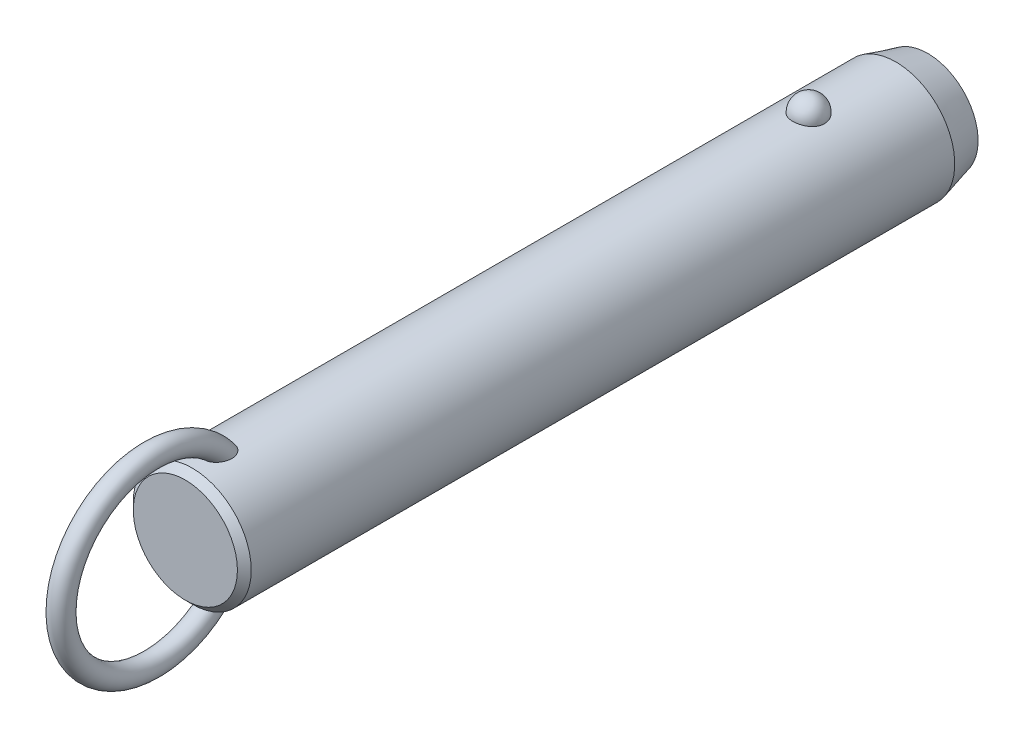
ISO-10303-21;
HEADER;
FILE_DESCRIPTION(('STEP AP214'),'2;1');
FILE_NAME('part.step','',(''),(''),'','','');
FILE_SCHEMA(('AUTOMOTIVE_DESIGN { 1 0 10303 214 1 1 1 1 }'));
ENDSEC;
DATA;
#1=APPLICATION_CONTEXT('core data for automotive mechanical design processes');
#2=APPLICATION_PROTOCOL_DEFINITION('international standard','automotive_design',2000,#1);
#3=PRODUCT_CONTEXT('',#1,'mechanical');
#4=PRODUCT('Part','Part','',(#3));
#5=PRODUCT_RELATED_PRODUCT_CATEGORY('part','',(#4));
#6=PRODUCT_DEFINITION_FORMATION('','',#4);
#7=PRODUCT_DEFINITION_CONTEXT('part definition',#1,'design');
#8=PRODUCT_DEFINITION('design','',#6,#7);
#9=PRODUCT_DEFINITION_SHAPE('','',#8);
#10=(LENGTH_UNIT() NAMED_UNIT(*) SI_UNIT(.MILLI.,.METRE.));
#11=(NAMED_UNIT(*) PLANE_ANGLE_UNIT() SI_UNIT($,.RADIAN.));
#12=(NAMED_UNIT(*) SI_UNIT($,.STERADIAN.) SOLID_ANGLE_UNIT());
#13=UNCERTAINTY_MEASURE_WITH_UNIT(LENGTH_MEASURE(1.E-05),#10,'distance_accuracy_value','');
#14=(GEOMETRIC_REPRESENTATION_CONTEXT(3) GLOBAL_UNCERTAINTY_ASSIGNED_CONTEXT((#13)) GLOBAL_UNIT_ASSIGNED_CONTEXT((#10,
#11,#12)) REPRESENTATION_CONTEXT('',''));
#15=CARTESIAN_POINT('',(0.,0.,0.));
#16=DIRECTION('',(0.,0.,1.));
#17=DIRECTION('',(1.,0.,0.));
#18=AXIS2_PLACEMENT_3D('',#15,#16,#17);
#19=CARTESIAN_POINT('',(0.,0.,101.6));
#20=DIRECTION('',(0.,0.,-1.));
#21=DIRECTION('',(-1.,0.,0.));
#22=AXIS2_PLACEMENT_3D('',#19,#20,#21);
#23=CYLINDRICAL_SURFACE('',#22,11.1);
#24=CARTESIAN_POINT('',(2.9724815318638,10.6945945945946,-3.));
#25=CARTESIAN_POINT('',(2.97247830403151,10.6945972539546,-2.83225059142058));
#26=CARTESIAN_POINT('',(2.95876598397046,10.6984356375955,-2.66445972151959));
#27=CARTESIAN_POINT('',(2.90424529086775,10.7133624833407,-2.33362381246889));
#28=CARTESIAN_POINT('',(2.8634252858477,10.7244540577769,-2.1705808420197));
#29=CARTESIAN_POINT('',(2.75573657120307,10.7526272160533,-1.85396767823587));
#30=CARTESIAN_POINT('',(2.68887937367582,10.7697061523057,-1.70039333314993));
#31=CARTESIAN_POINT('',(2.53079696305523,10.8079438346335,-1.40691598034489));
#32=CARTESIAN_POINT('',(2.43957264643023,10.8291024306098,-1.2670124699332));
#33=CARTESIAN_POINT('',(2.23458150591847,10.8732541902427,-1.00409565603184));
#34=CARTESIAN_POINT('',(2.12071295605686,10.8962553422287,-0.881162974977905));
#35=CARTESIAN_POINT('',(1.87365402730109,10.9414421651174,-0.656352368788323));
#36=CARTESIAN_POINT('',(1.74046358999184,10.9636278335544,-0.554474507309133));
#37=CARTESIAN_POINT('',(1.45872188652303,11.0046495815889,-0.374872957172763));
#38=CARTESIAN_POINT('',(1.31021276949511,11.0234944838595,-0.297085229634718));
#39=CARTESIAN_POINT('',(1.00170030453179,11.0557957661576,-0.167529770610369));
#40=CARTESIAN_POINT('',(0.841698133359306,11.0692526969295,-0.115759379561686));
#41=CARTESIAN_POINT('',(0.517607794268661,11.0890932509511,-0.0403925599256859));
#42=CARTESIAN_POINT('',(0.353633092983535,11.0955916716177,-0.0163383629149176));
#43=CARTESIAN_POINT('',(0.0238420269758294,11.1011989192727,0.0044517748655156));
#44=CARTESIAN_POINT('',(-0.141974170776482,11.1003084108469,0.00119017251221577));
#45=CARTESIAN_POINT('',(-0.468405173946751,11.0912990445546,-0.0323233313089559));
#46=CARTESIAN_POINT('',(-0.629059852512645,11.0832767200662,-0.0622147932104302));
#47=CARTESIAN_POINT('',(-0.942937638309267,11.0609962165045,-0.147645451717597));
#48=CARTESIAN_POINT('',(-1.09616062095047,11.0467379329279,-0.203185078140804));
#49=CARTESIAN_POINT('',(-1.39181061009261,11.0134071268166,-0.3387529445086));
#50=CARTESIAN_POINT('',(-1.53417383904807,10.9943086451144,-0.418913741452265));
#51=CARTESIAN_POINT('',(-1.80342160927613,10.9533667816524,-0.60144882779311));
#52=CARTESIAN_POINT('',(-1.9303046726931,10.9315231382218,-0.703825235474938));
#53=CARTESIAN_POINT('',(-2.16747598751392,10.887005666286,-0.930091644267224));
#54=CARTESIAN_POINT('',(-2.27742774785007,10.8643239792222,-1.05433291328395));
#55=CARTESIAN_POINT('',(-2.47517316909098,10.8209886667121,-1.31966633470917));
#56=CARTESIAN_POINT('',(-2.56296538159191,10.8003351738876,-1.46075958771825));
#57=CARTESIAN_POINT('',(-2.71500300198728,10.7631304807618,-1.75753646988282));
#58=CARTESIAN_POINT('',(-2.77898901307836,10.7466250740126,-1.91335887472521));
#59=CARTESIAN_POINT('',(-2.88046189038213,10.7198747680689,-2.2339152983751));
#60=CARTESIAN_POINT('',(-2.91794947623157,10.709629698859,-2.39864907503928));
#61=CARTESIAN_POINT('',(-2.96537819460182,10.6965949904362,-2.73165170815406));
#62=CARTESIAN_POINT('',(-2.97542891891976,10.693775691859,-2.89990378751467));
#63=CARTESIAN_POINT('',(-2.96804271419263,10.6958279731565,-3.235752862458));
#64=CARTESIAN_POINT('',(-2.95060646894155,10.7006993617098,-3.40334987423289));
#65=CARTESIAN_POINT('',(-2.88883358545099,10.71753912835,-3.73233906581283));
#66=CARTESIAN_POINT('',(-2.84462026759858,10.7294749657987,-3.89375610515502));
#67=CARTESIAN_POINT('',(-2.73050447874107,10.7590797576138,-4.20667949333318));
#68=CARTESIAN_POINT('',(-2.66060103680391,10.7767489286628,-4.35818546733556));
#69=CARTESIAN_POINT('',(-2.49642559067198,10.8159599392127,-4.6478542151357));
#70=CARTESIAN_POINT('',(-2.40203047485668,10.8375211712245,-4.78594458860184));
#71=CARTESIAN_POINT('',(-2.19143488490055,10.8820570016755,-5.0441038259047));
#72=CARTESIAN_POINT('',(-2.07523364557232,10.9050316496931,-5.16417205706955));
#73=CARTESIAN_POINT('',(-1.82361254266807,10.9499219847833,-5.38334833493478));
#74=CARTESIAN_POINT('',(-1.68812945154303,10.9718338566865,-5.48238464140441));
#75=CARTESIAN_POINT('',(-1.40191298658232,11.0120611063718,-5.65618873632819));
#76=CARTESIAN_POINT('',(-1.25118062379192,11.0303767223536,-5.73095813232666));
#77=CARTESIAN_POINT('',(-0.940570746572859,11.0611653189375,-5.85334725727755));
#78=CARTESIAN_POINT('',(-0.780821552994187,11.0737044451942,-5.90127578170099));
#79=CARTESIAN_POINT('',(-0.455204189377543,11.0918598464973,-5.96992976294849));
#80=CARTESIAN_POINT('',(-0.289336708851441,11.0974768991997,-5.99065827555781));
#81=CARTESIAN_POINT('',(0.0406846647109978,11.1011307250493,-6.00418773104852));
#82=CARTESIAN_POINT('',(0.204817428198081,11.099299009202,-5.99747318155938));
#83=CARTESIAN_POINT('',(0.5295530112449,11.088551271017,-5.9574031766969));
#84=CARTESIAN_POINT('',(0.69015594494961,11.0796354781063,-5.92404858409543));
#85=CARTESIAN_POINT('',(1.0027760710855,11.0557204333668,-5.83180084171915));
#86=CARTESIAN_POINT('',(1.15482001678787,11.0407414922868,-5.77299291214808));
#87=CARTESIAN_POINT('',(1.44678373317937,11.0062913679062,-5.63147366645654));
#88=CARTESIAN_POINT('',(1.58670279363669,10.9868199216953,-5.54876095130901));
#89=CARTESIAN_POINT('',(1.8527023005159,10.9451315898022,-5.36027644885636));
#90=CARTESIAN_POINT('',(1.97855158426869,10.9228788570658,-5.25418644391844));
#91=CARTESIAN_POINT('',(2.21080872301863,10.8782509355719,-5.02251354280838));
#92=CARTESIAN_POINT('',(2.31721312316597,10.8558757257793,-4.89692718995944));
#93=CARTESIAN_POINT('',(2.5094551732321,10.8130715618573,-4.62745408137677));
#94=CARTESIAN_POINT('',(2.59493284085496,10.7926798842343,-4.48330448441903));
#95=CARTESIAN_POINT('',(2.740862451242,10.7565495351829,-4.18236358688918));
#96=CARTESIAN_POINT('',(2.80132490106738,10.7408089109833,-4.02557762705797));
#97=CARTESIAN_POINT('',(2.88959070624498,10.7173718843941,-3.72475308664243));
#98=CARTESIAN_POINT('',(2.92062102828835,10.7088950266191,-3.58171216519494));
#99=CARTESIAN_POINT('',(2.96206765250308,10.6975052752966,-3.29245795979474));
#100=CARTESIAN_POINT('',(2.97248434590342,10.6945922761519,-3.14624473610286));
#101=CARTESIAN_POINT('',(2.9724815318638,10.6945945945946,-3.));
#102=B_SPLINE_CURVE_WITH_KNOTS('',3,(#24,#25,#26,#27,#28,#29,#30,#31,#32,#33,#34,#35,#36,#37,
#38,#39,#40,#41,#42,#43,#44,#45,#46,#47,#48,#49,#50,#51,#52,#53,#54,#55,#56,#57,#58,#59,#60,#61,
#62,#63,#64,#65,#66,#67,#68,#69,#70,#71,#72,#73,#74,#75,#76,#77,#78,#79,#80,#81,#82,#83,#84,#85,
#86,#87,#88,#89,#90,#91,#92,#93,#94,#95,#96,#97,#98,#99,#100,#101),.UNSPECIFIED.,.T.,.F.,(4,2,2,
2,2,2,2,2,2,2,2,2,2,2,2,2,2,2,2,2,2,2,2,2,2,2,2,2,2,2,2,2,2,2,2,2,2,2,4),(0.,0.502722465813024,
1.00566079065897,1.5083769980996,2.01107471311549,2.51608392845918,3.02109467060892,
3.52475118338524,4.02835620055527,4.523518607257,5.0186364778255,5.50715297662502,
5.9956776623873,6.48688002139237,6.97812923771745,7.47814366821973,7.9781907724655,
8.48353712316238,8.9888697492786,9.49218093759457,9.99547960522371,10.4964777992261,
10.997494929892,11.5010810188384,12.0046847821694,12.5099796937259,13.0152411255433,
13.5145635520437,14.0138298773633,14.5043200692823,14.9947943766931,15.4836390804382,
15.9725123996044,16.4685040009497,16.9645836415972,17.4686765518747,17.972557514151,
18.410841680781,18.849117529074),.UNSPECIFIED.);
#103=CARTESIAN_POINT('',(2.9724815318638,10.6945945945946,-3.));
#104=VERTEX_POINT('',#103);
#105=EDGE_CURVE('E41',#104,#104,#102,.T.);
#106=ORIENTED_EDGE('',*,*,#105,.T.);
#107=EDGE_LOOP('',(#106));
#108=FACE_BOUND('',#107,.T.);
#109=CARTESIAN_POINT('',(0.,0.,113.));
#110=DIRECTION('',(0.,0.,1.));
#111=DIRECTION('',(1.,0.,0.));
#112=AXIS2_PLACEMENT_3D('',#109,#110,#111);
#113=CIRCLE('',#112,11.1);
#114=CARTESIAN_POINT('',(11.1,0.,113.));
#115=VERTEX_POINT('',#114);
#116=EDGE_CURVE('E10',#115,#115,#113,.F.);
#117=ORIENTED_EDGE('',*,*,#116,.T.);
#118=EDGE_LOOP('',(#117));
#119=FACE_BOUND('',#118,.T.);
#120=CARTESIAN_POINT('',(-0.564520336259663,-11.0856356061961,105.257815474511));
#121=CARTESIAN_POINT('',(-0.667202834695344,-11.0804062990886,105.291283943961));
#122=CARTESIAN_POINT('',(-0.766875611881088,-11.0738877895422,105.333835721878));
#123=CARTESIAN_POINT('',(-0.957284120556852,-11.0590576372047,105.435419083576));
#124=CARTESIAN_POINT('',(-1.04801616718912,-11.0507452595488,105.49445742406));
#125=CARTESIAN_POINT('',(-1.21800952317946,-11.0333016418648,105.626529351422));
#126=CARTESIAN_POINT('',(-1.29730805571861,-11.0241732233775,105.699515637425));
#127=CARTESIAN_POINT('',(-1.44337665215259,-11.0060026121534,105.857037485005));
#128=CARTESIAN_POINT('',(-1.51014622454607,-10.9969604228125,105.941573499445));
#129=CARTESIAN_POINT('',(-1.63454620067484,-10.9791841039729,106.125521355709));
#130=CARTESIAN_POINT('',(-1.69127003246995,-10.9705107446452,106.225549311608));
#131=CARTESIAN_POINT('',(-1.78980785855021,-10.9548648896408,106.432790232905));
#132=CARTESIAN_POINT('',(-1.83161214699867,-10.9478935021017,106.540007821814));
#133=CARTESIAN_POINT('',(-1.91557028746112,-10.9335803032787,106.805408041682));
#134=CARTESIAN_POINT('',(-1.95040620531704,-10.9273269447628,106.965980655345));
#135=CARTESIAN_POINT('',(-1.99388326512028,-10.9194709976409,107.290697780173));
#136=CARTESIAN_POINT('',(-2.00248051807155,-10.9178762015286,107.454847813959));
#137=CARTESIAN_POINT('',(-1.99551615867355,-10.9191578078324,107.824650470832));
#138=CARTESIAN_POINT('',(-1.9732206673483,-10.9232807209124,108.030191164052));
#139=CARTESIAN_POINT('',(-1.91529761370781,-10.9335244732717,108.333595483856));
#140=CARTESIAN_POINT('',(-1.8918457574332,-10.9376266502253,108.434088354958));
#141=CARTESIAN_POINT('',(-1.83700674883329,-10.9469720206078,108.632855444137));
#142=CARTESIAN_POINT('',(-1.80562070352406,-10.9522150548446,108.731129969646));
#143=CARTESIAN_POINT('',(-1.73463055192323,-10.9636837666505,108.925914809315));
#144=CARTESIAN_POINT('',(-1.69493416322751,-10.9699202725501,109.022390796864));
#145=CARTESIAN_POINT('',(-1.60745141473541,-10.9830806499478,109.211626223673));
#146=CARTESIAN_POINT('',(-1.55966150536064,-10.9900048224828,109.304384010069));
#147=CARTESIAN_POINT('',(-1.45591812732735,-11.0042280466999,109.484690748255));
#148=CARTESIAN_POINT('',(-1.40000013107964,-11.0115253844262,109.572260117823));
#149=CARTESIAN_POINT('',(-1.27937470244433,-11.0261911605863,109.741029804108));
#150=CARTESIAN_POINT('',(-1.21467835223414,-11.0335594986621,109.82223795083));
#151=CARTESIAN_POINT('',(-1.08218150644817,-11.0473027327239,109.969001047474));
#152=CARTESIAN_POINT('',(-1.01522633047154,-11.0537063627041,110.035309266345));
#153=CARTESIAN_POINT('',(-0.872952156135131,-11.065850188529,110.158378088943));
#154=CARTESIAN_POINT('',(-0.797642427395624,-11.0715911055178,110.215149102));
#155=CARTESIAN_POINT('',(-0.651396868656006,-11.081071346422,110.307515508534));
#156=CARTESIAN_POINT('',(-0.581712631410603,-11.0849841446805,110.345049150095));
#157=CARTESIAN_POINT('',(-0.437066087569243,-11.0916271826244,110.408259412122));
#158=CARTESIAN_POINT('',(-0.362109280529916,-11.0943586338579,110.433948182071));
#159=CARTESIAN_POINT('',(-0.207828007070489,-11.0983242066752,110.471117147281));
#160=CARTESIAN_POINT('',(-0.128467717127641,-11.0995432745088,110.482454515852));
#161=CARTESIAN_POINT('',(0.0309101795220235,-11.1002423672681,110.488965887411));
#162=CARTESIAN_POINT('',(0.110927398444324,-11.0997233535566,110.484148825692));
#163=CARTESIAN_POINT('',(0.256406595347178,-11.097240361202,110.460959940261));
#164=CARTESIAN_POINT('',(0.32223577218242,-11.0955074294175,110.444754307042));
#165=CARTESIAN_POINT('',(0.450635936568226,-11.0910350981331,110.402600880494));
#166=CARTESIAN_POINT('',(0.513205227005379,-11.0882951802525,110.376648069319));
#167=CARTESIAN_POINT('',(0.662626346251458,-11.0805620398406,110.302607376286));
#168=CARTESIAN_POINT('',(0.747127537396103,-11.0751144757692,110.249845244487));
#169=CARTESIAN_POINT('',(0.906756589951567,-11.0631932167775,110.131720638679));
#170=CARTESIAN_POINT('',(0.981859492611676,-11.0567168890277,110.066325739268));
#171=CARTESIAN_POINT('',(1.10712207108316,-11.0447856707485,109.94226337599));
#172=CARTESIAN_POINT('',(1.15909566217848,-11.0394280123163,109.885383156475));
#173=CARTESIAN_POINT('',(1.25791923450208,-11.0286040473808,109.767327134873));
#174=CARTESIAN_POINT('',(1.30476642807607,-11.0231376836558,109.706149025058));
#175=CARTESIAN_POINT('',(1.43818612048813,-11.0068027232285,109.517305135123));
#176=CARTESIAN_POINT('',(1.51751767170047,-10.9960104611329,109.384453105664));
#177=CARTESIAN_POINT('',(1.63597546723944,-10.9788847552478,109.153137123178));
#178=CARTESIAN_POINT('',(1.67988876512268,-10.9722190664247,109.057053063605));
#179=CARTESIAN_POINT('',(1.75953241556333,-10.9597298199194,108.861431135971));
#180=CARTESIAN_POINT('',(1.79525967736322,-10.9539065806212,108.761891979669));
#181=CARTESIAN_POINT('',(1.85844731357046,-10.9433632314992,108.56021118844));
#182=CARTESIAN_POINT('',(1.88591073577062,-10.9386427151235,108.45807052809));
#183=CARTESIAN_POINT('',(1.93234324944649,-10.9305350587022,108.251819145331));
#184=CARTESIAN_POINT('',(1.95131065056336,-10.9271481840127,108.147708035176));
#185=CARTESIAN_POINT('',(1.99040203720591,-10.9201183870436,107.865458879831));
#186=CARTESIAN_POINT('',(2.00221217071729,-10.9179256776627,107.686037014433));
#187=CARTESIAN_POINT('',(1.99711676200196,-10.9188636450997,107.327713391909));
#188=CARTESIAN_POINT('',(1.98026150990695,-10.9219849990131,107.148811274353));
#189=CARTESIAN_POINT('',(1.92151657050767,-10.9324473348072,106.83645144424));
#190=CARTESIAN_POINT('',(1.88605081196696,-10.9386915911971,106.701759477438));
#191=CARTESIAN_POINT('',(1.7939302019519,-10.9541780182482,106.439966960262));
#192=CARTESIAN_POINT('',(1.73729868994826,-10.9634168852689,106.312858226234));
#193=CARTESIAN_POINT('',(1.612370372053,-10.9824218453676,106.089418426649));
#194=CARTESIAN_POINT('',(1.54715374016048,-10.9918945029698,105.991345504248));
#195=CARTESIAN_POINT('',(1.40127026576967,-11.0114415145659,105.807434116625));
#196=CARTESIAN_POINT('',(1.32060742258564,-11.0215157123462,105.721592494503));
#197=CARTESIAN_POINT('',(1.14474787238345,-11.041168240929,105.565163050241));
#198=CARTESIAN_POINT('',(1.04947805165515,-11.0507437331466,105.494656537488));
#199=CARTESIAN_POINT('',(0.847278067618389,-11.0680789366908,105.372640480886));
#200=CARTESIAN_POINT('',(0.740351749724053,-11.0758392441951,105.321124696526));
#201=CARTESIAN_POINT('',(0.529289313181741,-11.0878275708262,105.243485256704));
#202=CARTESIAN_POINT('',(0.425895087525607,-11.0923259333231,105.215377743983));
#203=CARTESIAN_POINT('',(0.215723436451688,-11.0984001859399,105.177703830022));
#204=CARTESIAN_POINT('',(0.108947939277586,-11.0999777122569,105.168127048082));
#205=CARTESIAN_POINT('',(-0.0938962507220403,-11.1000196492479,105.167877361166));
#206=CARTESIAN_POINT('',(-0.189967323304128,-11.0987797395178,105.175408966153));
#207=CARTESIAN_POINT('',(-0.379657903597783,-11.0939111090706,105.205507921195));
#208=CARTESIAN_POINT('',(-0.473277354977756,-11.0902823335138,105.228075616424));
#209=CARTESIAN_POINT('',(-0.564520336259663,-11.0856356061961,105.257815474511));
#210=B_SPLINE_CURVE_WITH_KNOTS('',3,(#120,#121,#122,#123,#124,#125,#126,#127,#128,#129,#130,
#131,#132,#133,#134,#135,#136,#137,#138,#139,#140,#141,#142,#143,#144,#145,#146,#147,#148,#149,
#150,#151,#152,#153,#154,#155,#156,#157,#158,#159,#160,#161,#162,#163,#164,#165,#166,#167,#168,
#169,#170,#171,#172,#173,#174,#175,#176,#177,#178,#179,#180,#181,#182,#183,#184,#185,#186,#187,
#188,#189,#190,#191,#192,#193,#194,#195,#196,#197,#198,#199,#200,#201,#202,#203,#204,#205,#206,
#207,#208,#209),.UNSPECIFIED.,.T.,.F.,(4,2,2,2,2,2,2,2,2,2,2,2,2,2,2,2,2,2,2,2,2,2,2,2,2,2,2,2,
2,2,2,2,2,2,2,2,2,2,2,2,2,2,2,2,4),(0.,0.323999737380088,0.648132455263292,0.971184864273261,
1.29424994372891,1.63886237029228,1.98369857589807,2.47426059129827,2.96564271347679,
3.58257396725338,3.89215258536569,4.20168803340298,4.51486273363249,4.82817514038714,
5.14015911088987,5.45175282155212,5.73442856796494,6.01679375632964,6.25364580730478,
6.49025437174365,6.7291996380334,6.96801276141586,7.17061258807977,7.37331685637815,
7.67094989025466,7.96935728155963,8.20075067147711,8.43226927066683,8.89581623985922,
9.21306533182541,9.53043400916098,9.84768549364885,10.1650000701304,10.70229304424,
11.2386443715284,11.6553390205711,12.0715755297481,12.4245637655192,12.7774607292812,
13.1321855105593,13.4867936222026,13.8068771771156,14.1267813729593,14.4146787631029,
14.7025827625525),.UNSPECIFIED.);
#211=CARTESIAN_POINT('',(-0.564520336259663,-11.0856356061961,105.257815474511));
#212=VERTEX_POINT('',#211);
#213=EDGE_CURVE('E60',#212,#212,#210,.T.);
#214=ORIENTED_EDGE('',*,*,#213,.T.);
#215=EDGE_LOOP('',(#214));
#216=FACE_BOUND('',#215,.T.);
#217=CARTESIAN_POINT('',(-0.564520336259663,11.0856356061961,105.257815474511));
#218=CARTESIAN_POINT('',(-0.468542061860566,11.0905203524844,105.226545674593));
#219=CARTESIAN_POINT('',(-0.36979381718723,11.0942886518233,105.203157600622));
#220=CARTESIAN_POINT('',(-0.169555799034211,11.0991586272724,105.173085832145));
#221=CARTESIAN_POINT('',(-0.0680604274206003,11.1002543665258,105.16643932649));
#222=CARTESIAN_POINT('',(0.134549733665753,11.099646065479,105.170157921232));
#223=CARTESIAN_POINT('',(0.235664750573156,11.0979441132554,105.18051033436));
#224=CARTESIAN_POINT('',(0.43463240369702,11.0919342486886,105.217831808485));
#225=CARTESIAN_POINT('',(0.532486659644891,11.0876276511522,105.244792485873));
#226=CARTESIAN_POINT('',(0.722445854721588,11.0768742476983,105.3144096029));
#227=CARTESIAN_POINT('',(0.814543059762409,11.0704246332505,105.357086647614));
#228=CARTESIAN_POINT('',(0.99056508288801,11.0560659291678,105.456648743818));
#229=CARTESIAN_POINT('',(1.07448844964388,11.048156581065,105.513536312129));
#230=CARTESIAN_POINT('',(1.23562672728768,11.0313221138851,105.642210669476));
#231=CARTESIAN_POINT('',(1.31242684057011,11.0223686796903,105.714511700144));
#232=CARTESIAN_POINT('',(1.45398030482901,11.0045918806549,105.870042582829));
#233=CARTESIAN_POINT('',(1.51873073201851,10.9957685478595,105.953275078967));
#234=CARTESIAN_POINT('',(1.64107232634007,10.9782087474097,106.136384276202));
#235=CARTESIAN_POINT('',(1.69743176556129,10.9695572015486,106.237089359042));
#236=CARTESIAN_POINT('',(1.79515063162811,10.9539887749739,106.445626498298));
#237=CARTESIAN_POINT('',(1.83649966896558,10.9470730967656,106.55346343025));
#238=CARTESIAN_POINT('',(1.91931148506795,10.9329211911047,106.820399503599));
#239=CARTESIAN_POINT('',(1.95340104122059,10.9267904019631,106.981861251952));
#240=CARTESIAN_POINT('',(1.99526195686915,10.9192174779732,107.30821631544));
#241=CARTESIAN_POINT('',(2.00298989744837,10.9177830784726,107.47311484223));
#242=CARTESIAN_POINT('',(1.99396251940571,10.9194420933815,107.844100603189));
#243=CARTESIAN_POINT('',(1.97050829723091,10.923774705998,108.05003871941));
#244=CARTESIAN_POINT('',(1.91079643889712,10.9343131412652,108.353901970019));
#245=CARTESIAN_POINT('',(1.88673702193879,10.9385106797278,108.454529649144));
#246=CARTESIAN_POINT('',(1.83065508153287,10.9480376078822,108.653510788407));
#247=CARTESIAN_POINT('',(1.79863369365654,10.9533668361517,108.751864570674));
#248=CARTESIAN_POINT('',(1.72633365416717,10.9649954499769,108.946720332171));
#249=CARTESIAN_POINT('',(1.68596409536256,10.9713053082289,109.04318790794));
#250=CARTESIAN_POINT('',(1.59707998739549,10.9845964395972,109.232323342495));
#251=CARTESIAN_POINT('',(1.54856169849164,10.9915780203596,109.324989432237));
#252=CARTESIAN_POINT('',(1.44330168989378,11.0058935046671,109.504975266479));
#253=CARTESIAN_POINT('',(1.38659749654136,11.0132257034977,109.592316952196));
#254=CARTESIAN_POINT('',(1.26431158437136,11.0279330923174,109.760456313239));
#255=CARTESIAN_POINT('',(1.19874160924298,11.0353082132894,109.841262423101));
#256=CARTESIAN_POINT('',(1.06542088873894,11.0489310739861,109.985985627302));
#257=CARTESIAN_POINT('',(0.998640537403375,11.0552153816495,110.050784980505));
#258=CARTESIAN_POINT('',(0.856896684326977,11.0671032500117,110.170846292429));
#259=CARTESIAN_POINT('',(0.781942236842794,11.0727075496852,110.226118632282));
#260=CARTESIAN_POINT('',(0.636276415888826,11.081949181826,110.315972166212));
#261=CARTESIAN_POINT('',(0.566755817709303,11.0857572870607,110.352441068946));
#262=CARTESIAN_POINT('',(0.422602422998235,11.0921860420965,110.413533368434));
#263=CARTESIAN_POINT('',(0.347974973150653,11.0948079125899,110.438168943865));
#264=CARTESIAN_POINT('',(0.194593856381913,11.0985608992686,110.473323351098));
#265=CARTESIAN_POINT('',(0.115807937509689,11.0996777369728,110.483706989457));
#266=CARTESIAN_POINT('',(-0.0422499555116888,11.1002003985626,110.488574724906));
#267=CARTESIAN_POINT('',(-0.121521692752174,11.09960699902,110.483066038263));
#268=CARTESIAN_POINT('',(-0.266046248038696,11.0970123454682,110.458827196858));
#269=CARTESIAN_POINT('',(-0.331661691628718,11.0952283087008,110.442135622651));
#270=CARTESIAN_POINT('',(-0.459588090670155,11.0906663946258,110.399111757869));
#271=CARTESIAN_POINT('',(-0.521897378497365,11.0878880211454,110.372774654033));
#272=CARTESIAN_POINT('',(-0.671446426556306,11.0800342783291,110.297513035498));
#273=CARTESIAN_POINT('',(-0.756250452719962,11.0744969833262,110.243818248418));
#274=CARTESIAN_POINT('',(-0.916349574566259,11.0624045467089,110.123802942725));
#275=CARTESIAN_POINT('',(-0.99161892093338,11.0558467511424,110.057449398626));
#276=CARTESIAN_POINT('',(-1.11713140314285,11.0437783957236,109.931633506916));
#277=CARTESIAN_POINT('',(-1.16920539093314,11.0383619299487,109.873952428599));
#278=CARTESIAN_POINT('',(-1.26817476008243,11.02743010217,109.754280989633));
#279=CARTESIAN_POINT('',(-1.31506731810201,11.0219146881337,109.692288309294));
#280=CARTESIAN_POINT('',(-1.40399813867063,11.0109399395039,109.564784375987));
#281=CARTESIAN_POINT('',(-1.4460286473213,11.0054807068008,109.499267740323));
#282=CARTESIAN_POINT('',(-1.52538779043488,10.9947621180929,109.365422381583));
#283=CARTESIAN_POINT('',(-1.56271516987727,10.9895028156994,109.297092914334));
#284=CARTESIAN_POINT('',(-1.64537943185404,10.9774790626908,109.133210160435));
#285=CARTESIAN_POINT('',(-1.68879497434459,10.9708503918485,109.0366735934));
#286=CARTESIAN_POINT('',(-1.76740738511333,10.9584602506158,108.840236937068));
#287=CARTESIAN_POINT('',(-1.80260120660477,10.95269910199,108.740335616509));
#288=CARTESIAN_POINT('',(-1.86468657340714,10.9423003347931,108.537966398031));
#289=CARTESIAN_POINT('',(-1.8915816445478,10.9376622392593,108.435499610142));
#290=CARTESIAN_POINT('',(-1.93682458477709,10.9297405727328,108.228642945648));
#291=CARTESIAN_POINT('',(-1.9551708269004,10.9264572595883,108.124252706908));
#292=CARTESIAN_POINT('',(-1.99232562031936,10.9197647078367,107.84262876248));
#293=CARTESIAN_POINT('',(-2.00294603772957,10.9177914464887,107.664185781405));
#294=CARTESIAN_POINT('',(-1.99566675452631,10.9191290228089,107.307996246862));
#295=CARTESIAN_POINT('',(-1.97781651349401,10.9224306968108,107.13024902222));
#296=CARTESIAN_POINT('',(-1.91747214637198,10.9331592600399,106.819792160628));
#297=CARTESIAN_POINT('',(-1.88131022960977,10.9395108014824,106.685825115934));
#298=CARTESIAN_POINT('',(-1.7879038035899,10.9551659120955,106.42559757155));
#299=CARTESIAN_POINT('',(-1.7306830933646,10.9644661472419,106.299328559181));
#300=CARTESIAN_POINT('',(-1.60475573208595,10.9835398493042,106.07741565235));
#301=CARTESIAN_POINT('',(-1.53908879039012,10.9930297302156,105.980026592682));
#302=CARTESIAN_POINT('',(-1.39238608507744,11.0125708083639,105.797525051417));
#303=CARTESIAN_POINT('',(-1.31135150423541,11.0226219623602,105.712411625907));
#304=CARTESIAN_POINT('',(-1.14382035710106,11.0411991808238,105.56529943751));
#305=CARTESIAN_POINT('',(-1.05858500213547,11.0497792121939,105.50186930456));
#306=CARTESIAN_POINT('',(-0.878723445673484,11.0655285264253,105.390250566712));
#307=CARTESIAN_POINT('',(-0.784123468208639,11.0727015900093,105.342020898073));
#308=CARTESIAN_POINT('',(-0.646163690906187,11.0812501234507,105.286023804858));
#309=CARTESIAN_POINT('',(-0.605595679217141,11.0835451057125,105.271197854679));
#310=CARTESIAN_POINT('',(-0.564520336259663,11.0856356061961,105.257815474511));
#311=B_SPLINE_CURVE_WITH_KNOTS('',3,(#217,#218,#219,#220,#221,#222,#223,#224,#225,#226,#227,
#228,#229,#230,#231,#232,#233,#234,#235,#236,#237,#238,#239,#240,#241,#242,#243,#244,#245,#246,
#247,#248,#249,#250,#251,#252,#253,#254,#255,#256,#257,#258,#259,#260,#261,#262,#263,#264,#265,
#266,#267,#268,#269,#270,#271,#272,#273,#274,#275,#276,#277,#278,#279,#280,#281,#282,#283,#284,
#285,#286,#287,#288,#289,#290,#291,#292,#293,#294,#295,#296,#297,#298,#299,#300,#301,#302,#303,
#304,#305,#306,#307,#308,#309,#310),.UNSPECIFIED.,.T.,.F.,(4,2,2,2,2,2,2,2,2,2,2,2,2,2,2,2,2,2,
2,2,2,2,2,2,2,2,2,2,2,2,2,2,2,2,2,2,2,2,2,2,2,2,2,2,2,2,4),(0.,0.303061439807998,
0.606795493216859,0.910302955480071,1.21365733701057,1.51741085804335,1.82121821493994,
2.13745205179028,2.45376252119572,2.79958678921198,3.14564996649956,3.6383239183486,
4.13180893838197,4.75031912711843,5.06071926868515,5.37107516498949,5.68500772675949,
5.99908475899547,6.31176519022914,6.62403542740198,6.90315673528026,7.1819719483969,
7.41687778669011,7.65154134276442,7.88841587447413,8.12518286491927,8.3275284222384,
8.52997509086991,8.82986421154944,9.13054668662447,9.36393502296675,9.59744991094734,
9.83133221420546,10.0652767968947,10.383032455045,10.7009056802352,11.0186436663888,
11.3364420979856,11.8705925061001,12.4038159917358,12.8189662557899,13.2336487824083,
13.5857049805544,13.9377340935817,14.2561354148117,14.5736690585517,14.7033687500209),.UNSPECIFIED.);
#312=CARTESIAN_POINT('',(-0.564520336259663,11.0856356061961,105.257815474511));
#313=VERTEX_POINT('',#312);
#314=EDGE_CURVE('E68',#313,#313,#311,.T.);
#315=ORIENTED_EDGE('',*,*,#314,.T.);
#316=EDGE_LOOP('',(#315));
#317=FACE_BOUND('',#316,.T.);
#318=CARTESIAN_POINT('',(0.,0.,-19.3999999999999));
#319=DIRECTION('',(0.,0.,-1.));
#320=DIRECTION('',(-1.,0.,0.));
#321=AXIS2_PLACEMENT_3D('',#318,#319,#320);
#322=CIRCLE('',#321,11.1);
#323=CARTESIAN_POINT('',(-11.1,0.,-19.3999999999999));
#324=VERTEX_POINT('',#323);
#325=EDGE_CURVE('E57',#324,#324,#322,.F.);
#326=ORIENTED_EDGE('',*,*,#325,.T.);
#327=EDGE_LOOP('',(#326));
#328=FACE_BOUND('',#327,.T.);
#329=ADVANCED_FACE('F37',(#108,#119,#216,#317,#328),#23,.T.);
#330=CARTESIAN_POINT('',(0.,0.,-25.4));
#331=DIRECTION('',(0.,0.,-1.));
#332=DIRECTION('',(-1.,0.,0.));
#333=AXIS2_PLACEMENT_3D('',#330,#331,#332);
#334=PLANE('',#333);
#335=CARTESIAN_POINT('',(0.,0.,-25.4));
#336=DIRECTION('',(0.,0.,-1.));
#337=DIRECTION('',(-1.,0.,0.));
#338=AXIS2_PLACEMENT_3D('',#335,#336,#337);
#339=CIRCLE('',#338,9.49230484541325);
#340=CARTESIAN_POINT('',(-9.49230484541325,0.,-25.4));
#341=VERTEX_POINT('',#340);
#342=EDGE_CURVE('E67',#341,#341,#339,.T.);
#343=ORIENTED_EDGE('',*,*,#342,.T.);
#344=EDGE_LOOP('',(#343));
#345=FACE_BOUND('',#344,.T.);
#346=ADVANCED_FACE('F86',(#345),#334,.T.);
#347=CARTESIAN_POINT('',(0.,0.,-25.4));
#348=DIRECTION('',(0.,0.,1.));
#349=DIRECTION('',(1.,0.,0.));
#350=AXIS2_PLACEMENT_3D('',#347,#348,#349);
#351=CONICAL_SURFACE('',#350,9.49230484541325,0.261799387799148);
#352=ORIENTED_EDGE('',*,*,#325,.F.);
#353=EDGE_LOOP('',(#352));
#354=FACE_BOUND('',#353,.T.);
#355=ORIENTED_EDGE('',*,*,#342,.F.);
#356=EDGE_LOOP('',(#355));
#357=FACE_BOUND('',#356,.T.);
#358=ADVANCED_FACE('F84',(#354,#357),#351,.T.);
#359=CARTESIAN_POINT('',(0.,0.,114.3));
#360=DIRECTION('',(0.,0.,1.));
#361=DIRECTION('',(1.,0.,0.));
#362=AXIS2_PLACEMENT_3D('',#359,#360,#361);
#363=PLANE('',#362);
#364=CARTESIAN_POINT('',(0.,0.,114.3));
#365=DIRECTION('',(0.,0.,1.));
#366=DIRECTION('',(1.,0.,0.));
#367=AXIS2_PLACEMENT_3D('',#364,#365,#366);
#368=CIRCLE('',#367,9.8);
#369=CARTESIAN_POINT('',(9.8,0.,114.3));
#370=VERTEX_POINT('',#369);
#371=EDGE_CURVE('E50',#370,#370,#368,.T.);
#372=ORIENTED_EDGE('',*,*,#371,.T.);
#373=EDGE_LOOP('',(#372));
#374=FACE_BOUND('',#373,.T.);
#375=ADVANCED_FACE('F78',(#374),#363,.T.);
#376=CARTESIAN_POINT('',(0.,0.,120.65));
#377=DIRECTION('',(1.,0.,0.));
#378=DIRECTION('',(0.,0.,-1.));
#379=AXIS2_PLACEMENT_3D('',#376,#377,#378);
#380=TOROIDAL_SURFACE('',#379,17.05,2.);
#381=ORIENTED_EDGE('',*,*,#314,.F.);
#382=EDGE_LOOP('',(#381));
#383=FACE_BOUND('',#382,.T.);
#384=ORIENTED_EDGE('',*,*,#213,.F.);
#385=EDGE_LOOP('',(#384));
#386=FACE_BOUND('',#385,.T.);
#387=ADVANCED_FACE('F74',(#383,#386),#380,.T.);
#388=CARTESIAN_POINT('',(0.,0.,114.3));
#389=DIRECTION('',(0.,0.,-1.));
#390=DIRECTION('',(-1.,0.,0.));
#391=AXIS2_PLACEMENT_3D('',#388,#389,#390);
#392=CONICAL_SURFACE('',#391,9.8,0.785398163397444);
#393=ORIENTED_EDGE('',*,*,#116,.F.);
#394=EDGE_LOOP('',(#393));
#395=FACE_BOUND('',#394,.T.);
#396=ORIENTED_EDGE('',*,*,#371,.F.);
#397=EDGE_LOOP('',(#396));
#398=FACE_BOUND('',#397,.T.);
#399=ADVANCED_FACE('F39',(#395,#398),#392,.T.);
#400=CARTESIAN_POINT('',(0.,11.1,-3.));
#401=DIRECTION('',(0.,1.,0.));
#402=DIRECTION('',(0.,0.,-1.));
#403=AXIS2_PLACEMENT_3D('',#400,#401,#402);
#404=SPHERICAL_SURFACE('',#403,3.);
#405=ORIENTED_EDGE('',*,*,#105,.F.);
#406=EDGE_LOOP('',(#405));
#407=FACE_BOUND('',#406,.T.);
#408=ADVANCED_FACE('F80',(#407),#404,.T.);
#409=CLOSED_SHELL('',(#329,#346,#358,#375,#387,#399,#408));
#410=MANIFOLD_SOLID_BREP('B2',#409);
#411=ADVANCED_BREP_SHAPE_REPRESENTATION('',(#18,#410),#14);
#412=SHAPE_DEFINITION_REPRESENTATION(#9,#411);
ENDSEC;
END-ISO-10303-21;
